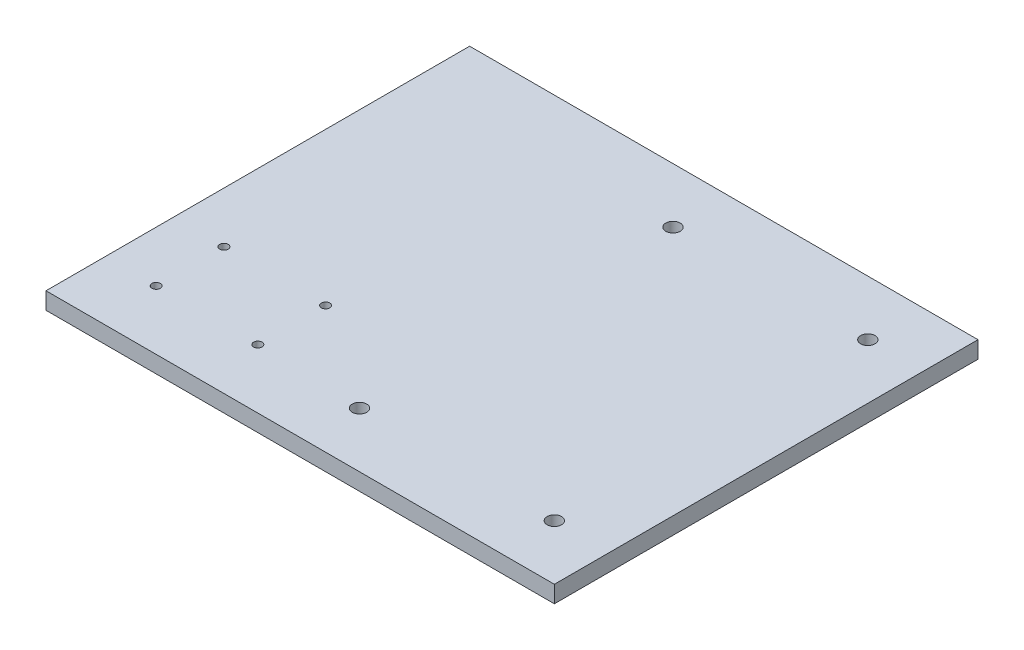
ISO-10303-21;
HEADER;
FILE_DESCRIPTION(('STEP AP214'),'2;1');
FILE_NAME('part.step','',(''),(''),'','','');
FILE_SCHEMA(('AUTOMOTIVE_DESIGN { 1 0 10303 214 1 1 1 1 }'));
ENDSEC;
DATA;
#1=APPLICATION_CONTEXT('core data for automotive mechanical design processes');
#2=APPLICATION_PROTOCOL_DEFINITION('international standard','automotive_design',2000,#1);
#3=PRODUCT_CONTEXT('',#1,'mechanical');
#4=PRODUCT('Part','Part','',(#3));
#5=PRODUCT_RELATED_PRODUCT_CATEGORY('part','',(#4));
#6=PRODUCT_DEFINITION_FORMATION('','',#4);
#7=PRODUCT_DEFINITION_CONTEXT('part definition',#1,'design');
#8=PRODUCT_DEFINITION('design','',#6,#7);
#9=PRODUCT_DEFINITION_SHAPE('','',#8);
#10=(LENGTH_UNIT() NAMED_UNIT(*) SI_UNIT(.MILLI.,.METRE.));
#11=(NAMED_UNIT(*) PLANE_ANGLE_UNIT() SI_UNIT($,.RADIAN.));
#12=(NAMED_UNIT(*) SI_UNIT($,.STERADIAN.) SOLID_ANGLE_UNIT());
#13=UNCERTAINTY_MEASURE_WITH_UNIT(LENGTH_MEASURE(1.E-05),#10,'distance_accuracy_value','');
#14=(GEOMETRIC_REPRESENTATION_CONTEXT(3) GLOBAL_UNCERTAINTY_ASSIGNED_CONTEXT((#13)) GLOBAL_UNIT_ASSIGNED_CONTEXT((#10,
#11,#12)) REPRESENTATION_CONTEXT('',''));
#15=CARTESIAN_POINT('',(0.,0.,0.));
#16=DIRECTION('',(0.,0.,1.));
#17=DIRECTION('',(1.,0.,0.));
#18=AXIS2_PLACEMENT_3D('',#15,#16,#17);
#19=CARTESIAN_POINT('',(0.,0.,-250.));
#20=DIRECTION('',(0.,-1.,0.));
#21=DIRECTION('',(0.,0.,-1.));
#22=AXIS2_PLACEMENT_3D('',#19,#20,#21);
#23=PLANE('',#22);
#24=CARTESIAN_POINT('',(267.5,0.,-217.5));
#25=DIRECTION('',(0.,1.,0.));
#26=DIRECTION('',(0.,0.,1.));
#27=AXIS2_PLACEMENT_3D('',#24,#25,#26);
#28=CIRCLE('',#27,4.24999999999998);
#29=CARTESIAN_POINT('',(267.5,0.,-213.25));
#30=VERTEX_POINT('',#29);
#31=EDGE_CURVE('E153',#30,#30,#28,.T.);
#32=ORIENTED_EDGE('',*,*,#31,.T.);
#33=EDGE_LOOP('',(#32));
#34=FACE_BOUND('',#33,.T.);
#35=CARTESIAN_POINT('',(152.5,0.,-217.5));
#36=DIRECTION('',(0.,1.,0.));
#37=DIRECTION('',(0.,0.,1.));
#38=AXIS2_PLACEMENT_3D('',#35,#36,#37);
#39=CIRCLE('',#38,4.25);
#40=CARTESIAN_POINT('',(152.5,0.,-213.25));
#41=VERTEX_POINT('',#40);
#42=EDGE_CURVE('E147',#41,#41,#39,.T.);
#43=ORIENTED_EDGE('',*,*,#42,.T.);
#44=EDGE_LOOP('',(#43));
#45=FACE_BOUND('',#44,.T.);
#46=CARTESIAN_POINT('',(267.5,0.,-32.5));
#47=DIRECTION('',(0.,1.,0.));
#48=DIRECTION('',(0.,0.,1.));
#49=AXIS2_PLACEMENT_3D('',#46,#47,#48);
#50=CIRCLE('',#49,4.24999999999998);
#51=CARTESIAN_POINT('',(267.5,0.,-28.25));
#52=VERTEX_POINT('',#51);
#53=EDGE_CURVE('E141',#52,#52,#50,.T.);
#54=ORIENTED_EDGE('',*,*,#53,.T.);
#55=EDGE_LOOP('',(#54));
#56=FACE_BOUND('',#55,.T.);
#57=CARTESIAN_POINT('',(152.5,0.,-32.5));
#58=DIRECTION('',(0.,1.,0.));
#59=DIRECTION('',(0.,0.,1.));
#60=AXIS2_PLACEMENT_3D('',#57,#58,#59);
#61=CIRCLE('',#60,4.25);
#62=CARTESIAN_POINT('',(152.5,0.,-28.25));
#63=VERTEX_POINT('',#62);
#64=EDGE_CURVE('E135',#63,#63,#61,.T.);
#65=ORIENTED_EDGE('',*,*,#64,.T.);
#66=EDGE_LOOP('',(#65));
#67=FACE_BOUND('',#66,.T.);
#68=CARTESIAN_POINT('',(90.,0.,-75.));
#69=DIRECTION('',(0.,1.,0.));
#70=DIRECTION('',(0.,0.,1.));
#71=AXIS2_PLACEMENT_3D('',#68,#69,#70);
#72=CIRCLE('',#71,2.5);
#73=CARTESIAN_POINT('',(90.,0.,-72.5));
#74=VERTEX_POINT('',#73);
#75=EDGE_CURVE('E129',#74,#74,#72,.T.);
#76=ORIENTED_EDGE('',*,*,#75,.T.);
#77=EDGE_LOOP('',(#76));
#78=FACE_BOUND('',#77,.T.);
#79=CARTESIAN_POINT('',(90.,0.,-35.));
#80=DIRECTION('',(0.,1.,0.));
#81=DIRECTION('',(0.,0.,1.));
#82=AXIS2_PLACEMENT_3D('',#79,#80,#81);
#83=CIRCLE('',#82,2.5);
#84=CARTESIAN_POINT('',(90.,0.,-32.5));
#85=VERTEX_POINT('',#84);
#86=EDGE_CURVE('E123',#85,#85,#83,.T.);
#87=ORIENTED_EDGE('',*,*,#86,.T.);
#88=EDGE_LOOP('',(#87));
#89=FACE_BOUND('',#88,.T.);
#90=CARTESIAN_POINT('',(30.,0.,-35.));
#91=DIRECTION('',(0.,1.,0.));
#92=DIRECTION('',(0.,0.,1.));
#93=AXIS2_PLACEMENT_3D('',#90,#91,#92);
#94=CIRCLE('',#93,2.5);
#95=CARTESIAN_POINT('',(30.,0.,-32.5));
#96=VERTEX_POINT('',#95);
#97=EDGE_CURVE('E117',#96,#96,#94,.T.);
#98=ORIENTED_EDGE('',*,*,#97,.T.);
#99=EDGE_LOOP('',(#98));
#100=FACE_BOUND('',#99,.T.);
#101=DIRECTION('',(0.,0.,1.));
#102=VECTOR('',#101,1.);
#103=CARTESIAN_POINT('',(0.,0.,0.));
#104=LINE('',#103,#102);
#105=CARTESIAN_POINT('',(0.,0.,-250.));
#106=VERTEX_POINT('',#105);
#107=CARTESIAN_POINT('',(0.,0.,0.));
#108=VERTEX_POINT('',#107);
#109=EDGE_CURVE('E95',#106,#108,#104,.T.);
#110=ORIENTED_EDGE('',*,*,#109,.F.);
#111=DIRECTION('',(-1.,0.,0.));
#112=VECTOR('',#111,1.);
#113=CARTESIAN_POINT('',(0.,0.,-250.));
#114=LINE('',#113,#112);
#115=CARTESIAN_POINT('',(300.,0.,-250.));
#116=VERTEX_POINT('',#115);
#117=EDGE_CURVE('E71',#116,#106,#114,.T.);
#118=ORIENTED_EDGE('',*,*,#117,.F.);
#119=DIRECTION('',(0.,0.,-1.));
#120=VECTOR('',#119,1.);
#121=CARTESIAN_POINT('',(300.,0.,0.));
#122=LINE('',#121,#120);
#123=CARTESIAN_POINT('',(300.,0.,0.));
#124=VERTEX_POINT('',#123);
#125=EDGE_CURVE('E65',#124,#116,#122,.T.);
#126=ORIENTED_EDGE('',*,*,#125,.F.);
#127=DIRECTION('',(1.,0.,0.));
#128=VECTOR('',#127,1.);
#129=CARTESIAN_POINT('',(0.,0.,0.));
#130=LINE('',#129,#128);
#131=EDGE_CURVE('E87',#108,#124,#130,.T.);
#132=ORIENTED_EDGE('',*,*,#131,.F.);
#133=EDGE_LOOP('',(#110,#118,#126,#132));
#134=FACE_BOUND('',#133,.T.);
#135=CARTESIAN_POINT('',(30.,0.,-75.));
#136=DIRECTION('',(0.,1.,0.));
#137=DIRECTION('',(0.,0.,1.));
#138=AXIS2_PLACEMENT_3D('',#135,#136,#137);
#139=CIRCLE('',#138,2.5);
#140=CARTESIAN_POINT('',(30.,0.,-72.5));
#141=VERTEX_POINT('',#140);
#142=EDGE_CURVE('E111',#141,#141,#139,.T.);
#143=ORIENTED_EDGE('',*,*,#142,.T.);
#144=EDGE_LOOP('',(#143));
#145=FACE_BOUND('',#144,.T.);
#146=ADVANCED_FACE('F31',(#34,#45,#56,#67,#78,#89,#100,#134,#145),#23,.T.);
#147=CARTESIAN_POINT('',(0.,10.,0.));
#148=DIRECTION('',(1.,0.,0.));
#149=DIRECTION('',(0.,0.,-1.));
#150=AXIS2_PLACEMENT_3D('',#147,#148,#149);
#151=PLANE('',#150);
#152=ORIENTED_EDGE('',*,*,#109,.T.);
#153=DIRECTION('',(0.,-1.,0.));
#154=VECTOR('',#153,1.);
#155=CARTESIAN_POINT('',(0.,10.,0.));
#156=LINE('',#155,#154);
#157=CARTESIAN_POINT('',(0.,10.,0.));
#158=VERTEX_POINT('',#157);
#159=EDGE_CURVE('E11',#158,#108,#156,.T.);
#160=ORIENTED_EDGE('',*,*,#159,.F.);
#161=DIRECTION('',(0.,0.,1.));
#162=VECTOR('',#161,1.);
#163=CARTESIAN_POINT('',(0.,10.,0.));
#164=LINE('',#163,#162);
#165=CARTESIAN_POINT('',(0.,10.,-250.));
#166=VERTEX_POINT('',#165);
#167=EDGE_CURVE('E83',#166,#158,#164,.T.);
#168=ORIENTED_EDGE('',*,*,#167,.F.);
#169=DIRECTION('',(0.,-1.,0.));
#170=VECTOR('',#169,1.);
#171=CARTESIAN_POINT('',(0.,10.,-250.));
#172=LINE('',#171,#170);
#173=EDGE_CURVE('E91',#166,#106,#172,.T.);
#174=ORIENTED_EDGE('',*,*,#173,.T.);
#175=EDGE_LOOP('',(#152,#160,#168,#174));
#176=FACE_BOUND('',#175,.T.);
#177=ADVANCED_FACE('F33',(#176),#151,.F.);
#178=CARTESIAN_POINT('',(0.,10.,0.));
#179=DIRECTION('',(0.,0.,-1.));
#180=DIRECTION('',(-1.,0.,0.));
#181=AXIS2_PLACEMENT_3D('',#178,#179,#180);
#182=PLANE('',#181);
#183=ORIENTED_EDGE('',*,*,#131,.T.);
#184=DIRECTION('',(0.,-1.,0.));
#185=VECTOR('',#184,1.);
#186=CARTESIAN_POINT('',(300.,10.,0.));
#187=LINE('',#186,#185);
#188=CARTESIAN_POINT('',(300.,10.,0.));
#189=VERTEX_POINT('',#188);
#190=EDGE_CURVE('E40',#189,#124,#187,.T.);
#191=ORIENTED_EDGE('',*,*,#190,.F.);
#192=DIRECTION('',(1.,0.,0.));
#193=VECTOR('',#192,1.);
#194=CARTESIAN_POINT('',(0.,10.,0.));
#195=LINE('',#194,#193);
#196=EDGE_CURVE('E78',#158,#189,#195,.T.);
#197=ORIENTED_EDGE('',*,*,#196,.F.);
#198=ORIENTED_EDGE('',*,*,#159,.T.);
#199=EDGE_LOOP('',(#183,#191,#197,#198));
#200=FACE_BOUND('',#199,.T.);
#201=ADVANCED_FACE('F86',(#200),#182,.F.);
#202=CARTESIAN_POINT('',(300.,10.,0.));
#203=DIRECTION('',(-1.,0.,0.));
#204=DIRECTION('',(0.,0.,1.));
#205=AXIS2_PLACEMENT_3D('',#202,#203,#204);
#206=PLANE('',#205);
#207=ORIENTED_EDGE('',*,*,#125,.T.);
#208=DIRECTION('',(0.,-1.,0.));
#209=VECTOR('',#208,1.);
#210=CARTESIAN_POINT('',(300.,10.,-250.));
#211=LINE('',#210,#209);
#212=CARTESIAN_POINT('',(300.,10.,-250.));
#213=VERTEX_POINT('',#212);
#214=EDGE_CURVE('E88',#213,#116,#211,.T.);
#215=ORIENTED_EDGE('',*,*,#214,.F.);
#216=DIRECTION('',(0.,0.,-1.));
#217=VECTOR('',#216,1.);
#218=CARTESIAN_POINT('',(300.,10.,0.));
#219=LINE('',#218,#217);
#220=EDGE_CURVE('E81',#189,#213,#219,.T.);
#221=ORIENTED_EDGE('',*,*,#220,.F.);
#222=ORIENTED_EDGE('',*,*,#190,.T.);
#223=EDGE_LOOP('',(#207,#215,#221,#222));
#224=FACE_BOUND('',#223,.T.);
#225=ADVANCED_FACE('F89',(#224),#206,.F.);
#226=CARTESIAN_POINT('',(0.,10.,-250.));
#227=DIRECTION('',(0.,0.,1.));
#228=DIRECTION('',(1.,0.,0.));
#229=AXIS2_PLACEMENT_3D('',#226,#227,#228);
#230=PLANE('',#229);
#231=ORIENTED_EDGE('',*,*,#117,.T.);
#232=ORIENTED_EDGE('',*,*,#173,.F.);
#233=DIRECTION('',(-1.,0.,0.));
#234=VECTOR('',#233,1.);
#235=CARTESIAN_POINT('',(0.,10.,-250.));
#236=LINE('',#235,#234);
#237=EDGE_CURVE('E48',#213,#166,#236,.T.);
#238=ORIENTED_EDGE('',*,*,#237,.F.);
#239=ORIENTED_EDGE('',*,*,#214,.T.);
#240=EDGE_LOOP('',(#231,#232,#238,#239));
#241=FACE_BOUND('',#240,.T.);
#242=ADVANCED_FACE('F103',(#241),#230,.F.);
#243=CARTESIAN_POINT('',(0.,10.,-250.));
#244=DIRECTION('',(0.,-1.,0.));
#245=DIRECTION('',(0.,0.,-1.));
#246=AXIS2_PLACEMENT_3D('',#243,#244,#245);
#247=PLANE('',#246);
#248=CARTESIAN_POINT('',(267.5,10.,-217.5));
#249=DIRECTION('',(0.,1.,0.));
#250=DIRECTION('',(0.,0.,1.));
#251=AXIS2_PLACEMENT_3D('',#248,#249,#250);
#252=CIRCLE('',#251,4.24999999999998);
#253=CARTESIAN_POINT('',(267.5,10.,-213.25));
#254=VERTEX_POINT('',#253);
#255=EDGE_CURVE('E150',#254,#254,#252,.T.);
#256=ORIENTED_EDGE('',*,*,#255,.F.);
#257=EDGE_LOOP('',(#256));
#258=FACE_BOUND('',#257,.T.);
#259=CARTESIAN_POINT('',(152.5,10.,-217.5));
#260=DIRECTION('',(0.,1.,0.));
#261=DIRECTION('',(0.,0.,1.));
#262=AXIS2_PLACEMENT_3D('',#259,#260,#261);
#263=CIRCLE('',#262,4.24999999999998);
#264=CARTESIAN_POINT('',(152.5,10.,-213.25));
#265=VERTEX_POINT('',#264);
#266=EDGE_CURVE('E144',#265,#265,#263,.T.);
#267=ORIENTED_EDGE('',*,*,#266,.F.);
#268=EDGE_LOOP('',(#267));
#269=FACE_BOUND('',#268,.T.);
#270=CARTESIAN_POINT('',(267.5,10.,-32.5));
#271=DIRECTION('',(0.,1.,0.));
#272=DIRECTION('',(0.,0.,1.));
#273=AXIS2_PLACEMENT_3D('',#270,#271,#272);
#274=CIRCLE('',#273,4.24999999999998);
#275=CARTESIAN_POINT('',(267.5,10.,-28.25));
#276=VERTEX_POINT('',#275);
#277=EDGE_CURVE('E138',#276,#276,#274,.T.);
#278=ORIENTED_EDGE('',*,*,#277,.F.);
#279=EDGE_LOOP('',(#278));
#280=FACE_BOUND('',#279,.T.);
#281=CARTESIAN_POINT('',(152.5,10.,-32.5));
#282=DIRECTION('',(0.,1.,0.));
#283=DIRECTION('',(0.,0.,1.));
#284=AXIS2_PLACEMENT_3D('',#281,#282,#283);
#285=CIRCLE('',#284,4.24999999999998);
#286=CARTESIAN_POINT('',(152.5,10.,-28.25));
#287=VERTEX_POINT('',#286);
#288=EDGE_CURVE('E132',#287,#287,#285,.T.);
#289=ORIENTED_EDGE('',*,*,#288,.F.);
#290=EDGE_LOOP('',(#289));
#291=FACE_BOUND('',#290,.T.);
#292=CARTESIAN_POINT('',(90.,10.,-75.));
#293=DIRECTION('',(0.,1.,0.));
#294=DIRECTION('',(0.,0.,1.));
#295=AXIS2_PLACEMENT_3D('',#292,#293,#294);
#296=CIRCLE('',#295,2.49999999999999);
#297=CARTESIAN_POINT('',(90.,10.,-72.5));
#298=VERTEX_POINT('',#297);
#299=EDGE_CURVE('E126',#298,#298,#296,.T.);
#300=ORIENTED_EDGE('',*,*,#299,.F.);
#301=EDGE_LOOP('',(#300));
#302=FACE_BOUND('',#301,.T.);
#303=CARTESIAN_POINT('',(90.,10.,-35.));
#304=DIRECTION('',(0.,1.,0.));
#305=DIRECTION('',(0.,0.,1.));
#306=AXIS2_PLACEMENT_3D('',#303,#304,#305);
#307=CIRCLE('',#306,2.49999999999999);
#308=CARTESIAN_POINT('',(90.,10.,-32.5));
#309=VERTEX_POINT('',#308);
#310=EDGE_CURVE('E120',#309,#309,#307,.T.);
#311=ORIENTED_EDGE('',*,*,#310,.F.);
#312=EDGE_LOOP('',(#311));
#313=FACE_BOUND('',#312,.T.);
#314=CARTESIAN_POINT('',(30.,10.,-35.));
#315=DIRECTION('',(0.,1.,0.));
#316=DIRECTION('',(0.,0.,1.));
#317=AXIS2_PLACEMENT_3D('',#314,#315,#316);
#318=CIRCLE('',#317,2.49999999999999);
#319=CARTESIAN_POINT('',(30.,10.,-32.5));
#320=VERTEX_POINT('',#319);
#321=EDGE_CURVE('E114',#320,#320,#318,.T.);
#322=ORIENTED_EDGE('',*,*,#321,.F.);
#323=EDGE_LOOP('',(#322));
#324=FACE_BOUND('',#323,.T.);
#325=CARTESIAN_POINT('',(30.,10.,-75.));
#326=DIRECTION('',(0.,1.,0.));
#327=DIRECTION('',(0.,0.,1.));
#328=AXIS2_PLACEMENT_3D('',#325,#326,#327);
#329=CIRCLE('',#328,2.49999999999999);
#330=CARTESIAN_POINT('',(30.,10.,-72.5));
#331=VERTEX_POINT('',#330);
#332=EDGE_CURVE('E98',#331,#331,#329,.T.);
#333=ORIENTED_EDGE('',*,*,#332,.F.);
#334=EDGE_LOOP('',(#333));
#335=FACE_BOUND('',#334,.T.);
#336=ORIENTED_EDGE('',*,*,#167,.T.);
#337=ORIENTED_EDGE('',*,*,#196,.T.);
#338=ORIENTED_EDGE('',*,*,#220,.T.);
#339=ORIENTED_EDGE('',*,*,#237,.T.);
#340=EDGE_LOOP('',(#336,#337,#338,#339));
#341=FACE_BOUND('',#340,.T.);
#342=ADVANCED_FACE('F79',(#258,#269,#280,#291,#302,#313,#324,#335,#341),#247,.F.);
#343=CARTESIAN_POINT('',(30.,10.,-75.));
#344=DIRECTION('',(0.,1.,0.));
#345=DIRECTION('',(0.,0.,1.));
#346=AXIS2_PLACEMENT_3D('',#343,#344,#345);
#347=CYLINDRICAL_SURFACE('',#346,2.49999999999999);
#348=ORIENTED_EDGE('',*,*,#142,.F.);
#349=EDGE_LOOP('',(#348));
#350=FACE_BOUND('',#349,.T.);
#351=ORIENTED_EDGE('',*,*,#332,.T.);
#352=EDGE_LOOP('',(#351));
#353=FACE_BOUND('',#352,.T.);
#354=ADVANCED_FACE('F168',(#350,#353),#347,.F.);
#355=CARTESIAN_POINT('',(30.,10.,-35.));
#356=DIRECTION('',(0.,1.,0.));
#357=DIRECTION('',(0.,0.,1.));
#358=AXIS2_PLACEMENT_3D('',#355,#356,#357);
#359=CYLINDRICAL_SURFACE('',#358,2.49999999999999);
#360=ORIENTED_EDGE('',*,*,#97,.F.);
#361=EDGE_LOOP('',(#360));
#362=FACE_BOUND('',#361,.T.);
#363=ORIENTED_EDGE('',*,*,#321,.T.);
#364=EDGE_LOOP('',(#363));
#365=FACE_BOUND('',#364,.T.);
#366=ADVANCED_FACE('F185',(#362,#365),#359,.F.);
#367=CARTESIAN_POINT('',(90.,10.,-35.));
#368=DIRECTION('',(0.,1.,0.));
#369=DIRECTION('',(0.,0.,1.));
#370=AXIS2_PLACEMENT_3D('',#367,#368,#369);
#371=CYLINDRICAL_SURFACE('',#370,2.5);
#372=ORIENTED_EDGE('',*,*,#86,.F.);
#373=EDGE_LOOP('',(#372));
#374=FACE_BOUND('',#373,.T.);
#375=ORIENTED_EDGE('',*,*,#310,.T.);
#376=EDGE_LOOP('',(#375));
#377=FACE_BOUND('',#376,.T.);
#378=ADVANCED_FACE('F191',(#374,#377),#371,.F.);
#379=CARTESIAN_POINT('',(90.,10.,-75.));
#380=DIRECTION('',(0.,1.,0.));
#381=DIRECTION('',(0.,0.,1.));
#382=AXIS2_PLACEMENT_3D('',#379,#380,#381);
#383=CYLINDRICAL_SURFACE('',#382,2.5);
#384=ORIENTED_EDGE('',*,*,#75,.F.);
#385=EDGE_LOOP('',(#384));
#386=FACE_BOUND('',#385,.T.);
#387=ORIENTED_EDGE('',*,*,#299,.T.);
#388=EDGE_LOOP('',(#387));
#389=FACE_BOUND('',#388,.T.);
#390=ADVANCED_FACE('F235',(#386,#389),#383,.F.);
#391=CARTESIAN_POINT('',(152.5,10.,-32.5));
#392=DIRECTION('',(0.,1.,0.));
#393=DIRECTION('',(0.,0.,1.));
#394=AXIS2_PLACEMENT_3D('',#391,#392,#393);
#395=CYLINDRICAL_SURFACE('',#394,4.24999999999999);
#396=ORIENTED_EDGE('',*,*,#64,.F.);
#397=EDGE_LOOP('',(#396));
#398=FACE_BOUND('',#397,.T.);
#399=ORIENTED_EDGE('',*,*,#288,.T.);
#400=EDGE_LOOP('',(#399));
#401=FACE_BOUND('',#400,.T.);
#402=ADVANCED_FACE('F229',(#398,#401),#395,.F.);
#403=CARTESIAN_POINT('',(267.5,10.,-32.5));
#404=DIRECTION('',(0.,1.,0.));
#405=DIRECTION('',(0.,0.,1.));
#406=AXIS2_PLACEMENT_3D('',#403,#404,#405);
#407=CYLINDRICAL_SURFACE('',#406,4.24999999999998);
#408=ORIENTED_EDGE('',*,*,#53,.F.);
#409=EDGE_LOOP('',(#408));
#410=FACE_BOUND('',#409,.T.);
#411=ORIENTED_EDGE('',*,*,#277,.T.);
#412=EDGE_LOOP('',(#411));
#413=FACE_BOUND('',#412,.T.);
#414=ADVANCED_FACE('F234',(#410,#413),#407,.F.);
#415=CARTESIAN_POINT('',(152.5,10.,-217.5));
#416=DIRECTION('',(0.,1.,0.));
#417=DIRECTION('',(0.,0.,1.));
#418=AXIS2_PLACEMENT_3D('',#415,#416,#417);
#419=CYLINDRICAL_SURFACE('',#418,4.24999999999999);
#420=ORIENTED_EDGE('',*,*,#42,.F.);
#421=EDGE_LOOP('',(#420));
#422=FACE_BOUND('',#421,.T.);
#423=ORIENTED_EDGE('',*,*,#266,.T.);
#424=EDGE_LOOP('',(#423));
#425=FACE_BOUND('',#424,.T.);
#426=ADVANCED_FACE('F162',(#422,#425),#419,.F.);
#427=CARTESIAN_POINT('',(267.5,10.,-217.5));
#428=DIRECTION('',(0.,1.,0.));
#429=DIRECTION('',(0.,0.,1.));
#430=AXIS2_PLACEMENT_3D('',#427,#428,#429);
#431=CYLINDRICAL_SURFACE('',#430,4.24999999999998);
#432=ORIENTED_EDGE('',*,*,#31,.F.);
#433=EDGE_LOOP('',(#432));
#434=FACE_BOUND('',#433,.T.);
#435=ORIENTED_EDGE('',*,*,#255,.T.);
#436=EDGE_LOOP('',(#435));
#437=FACE_BOUND('',#436,.T.);
#438=ADVANCED_FACE('F159',(#434,#437),#431,.F.);
#439=CLOSED_SHELL('',(#146,#177,#201,#225,#242,#342,#354,#366,#378,#390,#402,#414,#426,#438));
#440=MANIFOLD_SOLID_BREP('B2',#439);
#441=ADVANCED_BREP_SHAPE_REPRESENTATION('',(#18,#440),#14);
#442=SHAPE_DEFINITION_REPRESENTATION(#9,#441);
ENDSEC;
END-ISO-10303-21;
